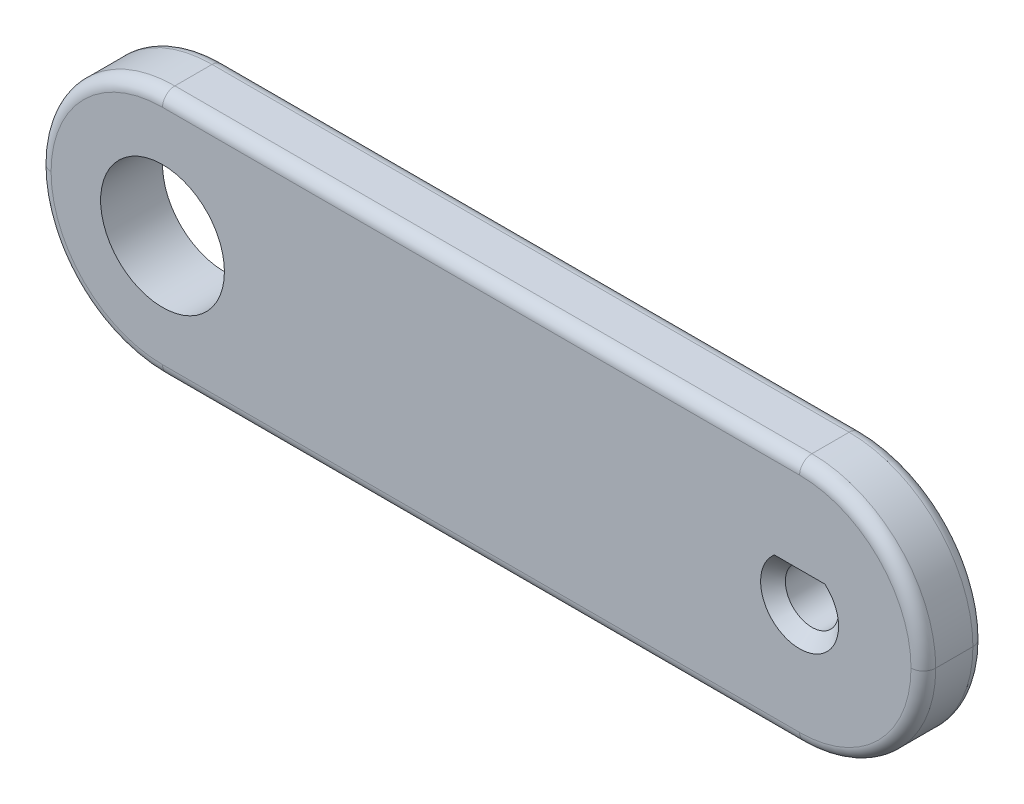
ISO-10303-21;
HEADER;
FILE_DESCRIPTION(('STEP AP214'),'2;1');
FILE_NAME('part.step','',(''),(''),'','','');
FILE_SCHEMA(('AUTOMOTIVE_DESIGN { 1 0 10303 214 1 1 1 1 }'));
ENDSEC;
DATA;
#1=APPLICATION_CONTEXT('core data for automotive mechanical design processes');
#2=APPLICATION_PROTOCOL_DEFINITION('international standard','automotive_design',2000,#1);
#3=PRODUCT_CONTEXT('',#1,'mechanical');
#4=PRODUCT('Part','Part','',(#3));
#5=PRODUCT_RELATED_PRODUCT_CATEGORY('part','',(#4));
#6=PRODUCT_DEFINITION_FORMATION('','',#4);
#7=PRODUCT_DEFINITION_CONTEXT('part definition',#1,'design');
#8=PRODUCT_DEFINITION('design','',#6,#7);
#9=PRODUCT_DEFINITION_SHAPE('','',#8);
#10=(LENGTH_UNIT() NAMED_UNIT(*) SI_UNIT(.MILLI.,.METRE.));
#11=(NAMED_UNIT(*) PLANE_ANGLE_UNIT() SI_UNIT($,.RADIAN.));
#12=(NAMED_UNIT(*) SI_UNIT($,.STERADIAN.) SOLID_ANGLE_UNIT());
#13=UNCERTAINTY_MEASURE_WITH_UNIT(LENGTH_MEASURE(1.E-05),#10,'distance_accuracy_value','');
#14=(GEOMETRIC_REPRESENTATION_CONTEXT(3) GLOBAL_UNCERTAINTY_ASSIGNED_CONTEXT((#13)) GLOBAL_UNIT_ASSIGNED_CONTEXT((#10,
#11,#12)) REPRESENTATION_CONTEXT('',''));
#15=CARTESIAN_POINT('',(0.,0.,0.));
#16=DIRECTION('',(0.,0.,1.));
#17=DIRECTION('',(1.,0.,0.));
#18=AXIS2_PLACEMENT_3D('',#15,#16,#17);
#19=CARTESIAN_POINT('',(0.,0.,5.));
#20=DIRECTION('',(0.,0.,1.));
#21=DIRECTION('',(1.,0.,0.));
#22=AXIS2_PLACEMENT_3D('',#19,#20,#21);
#23=PLANE('',#22);
#24=DIRECTION('',(1.,0.,0.));
#25=VECTOR('',#24,1.);
#26=CARTESIAN_POINT('',(-8.36828311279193,12.4,5.));
#27=LINE('',#26,#25);
#28=CARTESIAN_POINT('',(-12.0402205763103,12.4,5.));
#29=VERTEX_POINT('',#28);
#30=CARTESIAN_POINT('',(-7.95977942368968,12.4,5.));
#31=VERTEX_POINT('',#30);
#32=EDGE_CURVE('E70',#29,#31,#27,.T.);
#33=ORIENTED_EDGE('',*,*,#32,.T.);
#34=CARTESIAN_POINT('',(-10.,10.,5.));
#35=DIRECTION('',(0.,0.,1.));
#36=DIRECTION('',(1.,0.,0.));
#37=AXIS2_PLACEMENT_3D('',#34,#35,#36);
#38=CIRCLE('',#37,3.15000000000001);
#39=EDGE_CURVE('E63',#31,#29,#38,.F.);
#40=ORIENTED_EDGE('',*,*,#39,.T.);
#41=EDGE_LOOP('',(#33,#40));
#42=FACE_BOUND('',#41,.T.);
#43=CARTESIAN_POINT('',(-10.,10.,5.));
#44=DIRECTION('',(0.,0.,1.));
#45=DIRECTION('',(1.,0.,0.));
#46=AXIS2_PLACEMENT_3D('',#43,#44,#45);
#47=CIRCLE('',#46,9.);
#48=CARTESIAN_POINT('',(-10.,0.999999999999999,5.));
#49=VERTEX_POINT('',#48);
#50=CARTESIAN_POINT('',(-1.,10.,5.));
#51=VERTEX_POINT('',#50);
#52=EDGE_CURVE('E283',#49,#51,#47,.T.);
#53=ORIENTED_EDGE('',*,*,#52,.T.);
#54=CARTESIAN_POINT('',(-10.,10.,5.));
#55=DIRECTION('',(0.,0.,1.));
#56=DIRECTION('',(1.,0.,0.));
#57=AXIS2_PLACEMENT_3D('',#54,#55,#56);
#58=CIRCLE('',#57,9.);
#59=CARTESIAN_POINT('',(-10.,19.,5.));
#60=VERTEX_POINT('',#59);
#61=EDGE_CURVE('E286',#51,#60,#58,.T.);
#62=ORIENTED_EDGE('',*,*,#61,.T.);
#63=DIRECTION('',(-1.,0.,0.));
#64=VECTOR('',#63,1.);
#65=CARTESIAN_POINT('',(-61.46,19.,5.));
#66=LINE('',#65,#64);
#67=CARTESIAN_POINT('',(-61.46,19.,5.));
#68=VERTEX_POINT('',#67);
#69=EDGE_CURVE('E271',#60,#68,#66,.T.);
#70=ORIENTED_EDGE('',*,*,#69,.T.);
#71=CARTESIAN_POINT('',(-61.46,10.,5.));
#72=DIRECTION('',(0.,0.,1.));
#73=DIRECTION('',(1.,0.,0.));
#74=AXIS2_PLACEMENT_3D('',#71,#72,#73);
#75=CIRCLE('',#74,9.);
#76=CARTESIAN_POINT('',(-70.46,10.,5.));
#77=VERTEX_POINT('',#76);
#78=EDGE_CURVE('E274',#68,#77,#75,.T.);
#79=ORIENTED_EDGE('',*,*,#78,.T.);
#80=CARTESIAN_POINT('',(-61.46,9.99999999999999,5.));
#81=DIRECTION('',(0.,0.,1.));
#82=DIRECTION('',(1.,0.,0.));
#83=AXIS2_PLACEMENT_3D('',#80,#81,#82);
#84=CIRCLE('',#83,9.);
#85=CARTESIAN_POINT('',(-61.46,0.999999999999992,5.));
#86=VERTEX_POINT('',#85);
#87=EDGE_CURVE('E277',#77,#86,#84,.T.);
#88=ORIENTED_EDGE('',*,*,#87,.T.);
#89=DIRECTION('',(1.,0.,0.));
#90=VECTOR('',#89,1.);
#91=CARTESIAN_POINT('',(-10.,0.999999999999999,5.));
#92=LINE('',#91,#90);
#93=EDGE_CURVE('E280',#86,#49,#92,.T.);
#94=ORIENTED_EDGE('',*,*,#93,.T.);
#95=EDGE_LOOP('',(#53,#62,#70,#79,#88,#94));
#96=FACE_BOUND('',#95,.T.);
#97=CARTESIAN_POINT('',(-61.46,10.,5.));
#98=DIRECTION('',(0.,0.,1.));
#99=DIRECTION('',(1.,0.,0.));
#100=AXIS2_PLACEMENT_3D('',#97,#98,#99);
#101=CIRCLE('',#100,5.);
#102=CARTESIAN_POINT('',(-56.46,10.,5.));
#103=VERTEX_POINT('',#102);
#104=EDGE_CURVE('E187',#103,#103,#101,.T.);
#105=ORIENTED_EDGE('',*,*,#104,.F.);
#106=EDGE_LOOP('',(#105));
#107=FACE_BOUND('',#106,.T.);
#108=ADVANCED_FACE('F47',(#42,#96,#107),#23,.T.);
#109=CARTESIAN_POINT('',(0.,0.,0.));
#110=DIRECTION('',(0.,0.,1.));
#111=DIRECTION('',(1.,0.,0.));
#112=AXIS2_PLACEMENT_3D('',#109,#110,#111);
#113=PLANE('',#112);
#114=DIRECTION('',(-1.,0.,0.));
#115=VECTOR('',#114,1.);
#116=CARTESIAN_POINT('',(0.,19.,0.));
#117=LINE('',#116,#115);
#118=CARTESIAN_POINT('',(-61.46,19.,0.));
#119=VERTEX_POINT('',#118);
#120=CARTESIAN_POINT('',(-10.,19.,0.));
#121=VERTEX_POINT('',#120);
#122=EDGE_CURVE('E212',#119,#121,#117,.F.);
#123=ORIENTED_EDGE('',*,*,#122,.T.);
#124=CARTESIAN_POINT('',(-10.,10.,0.));
#125=DIRECTION('',(0.,0.,1.));
#126=DIRECTION('',(1.,0.,0.));
#127=AXIS2_PLACEMENT_3D('',#124,#125,#126);
#128=CIRCLE('',#127,9.);
#129=CARTESIAN_POINT('',(-1.,10.,0.));
#130=VERTEX_POINT('',#129);
#131=EDGE_CURVE('E235',#121,#130,#128,.F.);
#132=ORIENTED_EDGE('',*,*,#131,.T.);
#133=CARTESIAN_POINT('',(-10.,10.,0.));
#134=DIRECTION('',(0.,0.,1.));
#135=DIRECTION('',(1.,0.,0.));
#136=AXIS2_PLACEMENT_3D('',#133,#134,#135);
#137=CIRCLE('',#136,9.);
#138=CARTESIAN_POINT('',(-10.,0.999999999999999,0.));
#139=VERTEX_POINT('',#138);
#140=EDGE_CURVE('E232',#130,#139,#137,.F.);
#141=ORIENTED_EDGE('',*,*,#140,.T.);
#142=DIRECTION('',(1.,0.,0.));
#143=VECTOR('',#142,1.);
#144=CARTESIAN_POINT('',(0.,1.,0.));
#145=LINE('',#144,#143);
#146=CARTESIAN_POINT('',(-61.46,0.999999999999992,0.));
#147=VERTEX_POINT('',#146);
#148=EDGE_CURVE('E229',#139,#147,#145,.F.);
#149=ORIENTED_EDGE('',*,*,#148,.T.);
#150=CARTESIAN_POINT('',(-61.46,9.99999999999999,0.));
#151=DIRECTION('',(0.,0.,1.));
#152=DIRECTION('',(1.,0.,0.));
#153=AXIS2_PLACEMENT_3D('',#150,#151,#152);
#154=CIRCLE('',#153,9.);
#155=CARTESIAN_POINT('',(-70.46,10.,0.));
#156=VERTEX_POINT('',#155);
#157=EDGE_CURVE('E226',#147,#156,#154,.F.);
#158=ORIENTED_EDGE('',*,*,#157,.T.);
#159=CARTESIAN_POINT('',(-61.46,10.,0.));
#160=DIRECTION('',(0.,0.,1.));
#161=DIRECTION('',(1.,0.,0.));
#162=AXIS2_PLACEMENT_3D('',#159,#160,#161);
#163=CIRCLE('',#162,9.);
#164=EDGE_CURVE('E223',#156,#119,#163,.F.);
#165=ORIENTED_EDGE('',*,*,#164,.T.);
#166=EDGE_LOOP('',(#123,#132,#141,#149,#158,#165));
#167=FACE_BOUND('',#166,.T.);
#168=CARTESIAN_POINT('',(-61.46,10.,0.));
#169=DIRECTION('',(0.,0.,1.));
#170=DIRECTION('',(1.,0.,0.));
#171=AXIS2_PLACEMENT_3D('',#168,#169,#170);
#172=CIRCLE('',#171,5.);
#173=CARTESIAN_POINT('',(-56.46,10.,0.));
#174=VERTEX_POINT('',#173);
#175=EDGE_CURVE('E192',#174,#174,#172,.T.);
#176=ORIENTED_EDGE('',*,*,#175,.T.);
#177=EDGE_LOOP('',(#176));
#178=FACE_BOUND('',#177,.T.);
#179=DIRECTION('',(1.,0.,0.));
#180=VECTOR('',#179,1.);
#181=CARTESIAN_POINT('',(-11.6317168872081,11.4,0.));
#182=LINE('',#181,#180);
#183=CARTESIAN_POINT('',(-11.6317168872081,11.4,0.));
#184=VERTEX_POINT('',#183);
#185=CARTESIAN_POINT('',(-8.36828311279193,11.4,0.));
#186=VERTEX_POINT('',#185);
#187=EDGE_CURVE('E165',#184,#186,#182,.T.);
#188=ORIENTED_EDGE('',*,*,#187,.F.);
#189=CARTESIAN_POINT('',(-10.,10.,0.));
#190=DIRECTION('',(0.,0.,1.));
#191=DIRECTION('',(1.,0.,0.));
#192=AXIS2_PLACEMENT_3D('',#189,#190,#191);
#193=CIRCLE('',#192,2.15);
#194=EDGE_CURVE('E161',#186,#184,#193,.F.);
#195=ORIENTED_EDGE('',*,*,#194,.F.);
#196=EDGE_LOOP('',(#188,#195));
#197=FACE_BOUND('',#196,.T.);
#198=ADVANCED_FACE('F163',(#167,#178,#197),#113,.F.);
#199=CARTESIAN_POINT('',(0.,20.,5.));
#200=DIRECTION('',(0.,-1.,0.));
#201=DIRECTION('',(1.,0.,0.));
#202=AXIS2_PLACEMENT_3D('',#199,#200,#201);
#203=PLANE('',#202);
#204=DIRECTION('',(0.,0.,-1.));
#205=VECTOR('',#204,1.);
#206=CARTESIAN_POINT('',(-10.,20.,5.));
#207=LINE('',#206,#205);
#208=CARTESIAN_POINT('',(-10.,20.,4.));
#209=VERTEX_POINT('',#208);
#210=CARTESIAN_POINT('',(-10.,20.,1.));
#211=VERTEX_POINT('',#210);
#212=EDGE_CURVE('E204',#209,#211,#207,.T.);
#213=ORIENTED_EDGE('',*,*,#212,.T.);
#214=DIRECTION('',(-1.,0.,0.));
#215=VECTOR('',#214,1.);
#216=CARTESIAN_POINT('',(0.,20.,1.));
#217=LINE('',#216,#215);
#218=CARTESIAN_POINT('',(-61.46,20.,1.));
#219=VERTEX_POINT('',#218);
#220=EDGE_CURVE('E293',#211,#219,#217,.T.);
#221=ORIENTED_EDGE('',*,*,#220,.T.);
#222=DIRECTION('',(0.,0.,-1.));
#223=VECTOR('',#222,1.);
#224=CARTESIAN_POINT('',(-61.46,20.,5.));
#225=LINE('',#224,#223);
#226=CARTESIAN_POINT('',(-61.46,20.,4.));
#227=VERTEX_POINT('',#226);
#228=EDGE_CURVE('E208',#219,#227,#225,.F.);
#229=ORIENTED_EDGE('',*,*,#228,.T.);
#230=DIRECTION('',(-1.,0.,0.));
#231=VECTOR('',#230,1.);
#232=CARTESIAN_POINT('',(-10.,20.,4.));
#233=LINE('',#232,#231);
#234=EDGE_CURVE('E290',#227,#209,#233,.F.);
#235=ORIENTED_EDGE('',*,*,#234,.T.);
#236=EDGE_LOOP('',(#213,#221,#229,#235));
#237=FACE_BOUND('',#236,.T.);
#238=ADVANCED_FACE('F422',(#237),#203,.F.);
#239=CARTESIAN_POINT('',(0.,0.,5.));
#240=DIRECTION('',(0.,1.,0.));
#241=DIRECTION('',(-1.,0.,0.));
#242=AXIS2_PLACEMENT_3D('',#239,#240,#241);
#243=PLANE('',#242);
#244=DIRECTION('',(0.,0.,-1.));
#245=VECTOR('',#244,1.);
#246=CARTESIAN_POINT('',(-61.46,0.,5.));
#247=LINE('',#246,#245);
#248=CARTESIAN_POINT('',(-61.46,0.,4.));
#249=VERTEX_POINT('',#248);
#250=CARTESIAN_POINT('',(-61.46,0.,1.));
#251=VERTEX_POINT('',#250);
#252=EDGE_CURVE('E200',#249,#251,#247,.T.);
#253=ORIENTED_EDGE('',*,*,#252,.T.);
#254=DIRECTION('',(1.,0.,0.));
#255=VECTOR('',#254,1.);
#256=CARTESIAN_POINT('',(0.,0.,1.));
#257=LINE('',#256,#255);
#258=CARTESIAN_POINT('',(-10.,0.,1.));
#259=VERTEX_POINT('',#258);
#260=EDGE_CURVE('E256',#251,#259,#257,.T.);
#261=ORIENTED_EDGE('',*,*,#260,.T.);
#262=DIRECTION('',(0.,0.,-1.));
#263=VECTOR('',#262,1.);
#264=CARTESIAN_POINT('',(-10.,0.,5.));
#265=LINE('',#264,#263);
#266=CARTESIAN_POINT('',(-10.,0.,4.));
#267=VERTEX_POINT('',#266);
#268=EDGE_CURVE('E191',#259,#267,#265,.F.);
#269=ORIENTED_EDGE('',*,*,#268,.T.);
#270=DIRECTION('',(1.,0.,0.));
#271=VECTOR('',#270,1.);
#272=CARTESIAN_POINT('',(-61.46,0.,4.));
#273=LINE('',#272,#271);
#274=EDGE_CURVE('E253',#267,#249,#273,.F.);
#275=ORIENTED_EDGE('',*,*,#274,.T.);
#276=EDGE_LOOP('',(#253,#261,#269,#275));
#277=FACE_BOUND('',#276,.T.);
#278=ADVANCED_FACE('F425',(#277),#243,.F.);
#279=CARTESIAN_POINT('',(-61.46,10.,5.));
#280=DIRECTION('',(0.,0.,-1.));
#281=DIRECTION('',(-1.,0.,0.));
#282=AXIS2_PLACEMENT_3D('',#279,#280,#281);
#283=CYLINDRICAL_SURFACE('',#282,5.);
#284=ORIENTED_EDGE('',*,*,#104,.T.);
#285=EDGE_LOOP('',(#284));
#286=FACE_BOUND('',#285,.T.);
#287=ORIENTED_EDGE('',*,*,#175,.F.);
#288=EDGE_LOOP('',(#287));
#289=FACE_BOUND('',#288,.T.);
#290=ADVANCED_FACE('F417',(#286,#289),#283,.F.);
#291=CARTESIAN_POINT('',(-61.46,10.,5.));
#292=DIRECTION('',(0.,0.,-1.));
#293=DIRECTION('',(-1.,0.,0.));
#294=AXIS2_PLACEMENT_3D('',#291,#292,#293);
#295=CYLINDRICAL_SURFACE('',#294,10.);
#296=ORIENTED_EDGE('',*,*,#228,.F.);
#297=CARTESIAN_POINT('',(-61.46,10.,1.));
#298=DIRECTION('',(0.,0.,1.));
#299=DIRECTION('',(1.,0.,0.));
#300=AXIS2_PLACEMENT_3D('',#297,#298,#299);
#301=CIRCLE('',#300,10.);
#302=CARTESIAN_POINT('',(-71.46,10.,1.));
#303=VERTEX_POINT('',#302);
#304=EDGE_CURVE('E268',#219,#303,#301,.T.);
#305=ORIENTED_EDGE('',*,*,#304,.T.);
#306=DIRECTION('',(0.,0.,-1.));
#307=VECTOR('',#306,1.);
#308=CARTESIAN_POINT('',(-71.46,10.,5.));
#309=LINE('',#308,#307);
#310=CARTESIAN_POINT('',(-71.46,10.,4.));
#311=VERTEX_POINT('',#310);
#312=EDGE_CURVE('E196',#311,#303,#309,.T.);
#313=ORIENTED_EDGE('',*,*,#312,.F.);
#314=CARTESIAN_POINT('',(-61.46,10.,4.));
#315=DIRECTION('',(0.,0.,1.));
#316=DIRECTION('',(1.,0.,0.));
#317=AXIS2_PLACEMENT_3D('',#314,#315,#316);
#318=CIRCLE('',#317,10.);
#319=EDGE_CURVE('E265',#311,#227,#318,.F.);
#320=ORIENTED_EDGE('',*,*,#319,.T.);
#321=EDGE_LOOP('',(#296,#305,#313,#320));
#322=FACE_BOUND('',#321,.T.);
#323=ADVANCED_FACE('F414',(#322),#295,.T.);
#324=CARTESIAN_POINT('',(-61.46,9.99999999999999,5.));
#325=DIRECTION('',(0.,0.,-1.));
#326=DIRECTION('',(-1.,0.,0.));
#327=AXIS2_PLACEMENT_3D('',#324,#325,#326);
#328=CYLINDRICAL_SURFACE('',#327,10.);
#329=ORIENTED_EDGE('',*,*,#312,.T.);
#330=CARTESIAN_POINT('',(-61.46,9.99999999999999,1.));
#331=DIRECTION('',(0.,0.,1.));
#332=DIRECTION('',(1.,0.,0.));
#333=AXIS2_PLACEMENT_3D('',#330,#331,#332);
#334=CIRCLE('',#333,10.);
#335=EDGE_CURVE('E262',#303,#251,#334,.T.);
#336=ORIENTED_EDGE('',*,*,#335,.T.);
#337=ORIENTED_EDGE('',*,*,#252,.F.);
#338=CARTESIAN_POINT('',(-61.46,9.99999999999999,4.));
#339=DIRECTION('',(0.,0.,1.));
#340=DIRECTION('',(1.,0.,0.));
#341=AXIS2_PLACEMENT_3D('',#338,#339,#340);
#342=CIRCLE('',#341,10.);
#343=EDGE_CURVE('E259',#249,#311,#342,.F.);
#344=ORIENTED_EDGE('',*,*,#343,.T.);
#345=EDGE_LOOP('',(#329,#336,#337,#344));
#346=FACE_BOUND('',#345,.T.);
#347=ADVANCED_FACE('F409',(#346),#328,.T.);
#348=CARTESIAN_POINT('',(-10.,10.,5.));
#349=DIRECTION('',(0.,0.,-1.));
#350=DIRECTION('',(-1.,0.,0.));
#351=AXIS2_PLACEMENT_3D('',#348,#349,#350);
#352=CYLINDRICAL_SURFACE('',#351,10.);
#353=DIRECTION('',(0.,0.,-1.));
#354=VECTOR('',#353,1.);
#355=CARTESIAN_POINT('',(0.,10.,5.));
#356=LINE('',#355,#354);
#357=CARTESIAN_POINT('',(0.,10.,1.));
#358=VERTEX_POINT('',#357);
#359=CARTESIAN_POINT('',(0.,10.,4.));
#360=VERTEX_POINT('',#359);
#361=EDGE_CURVE('E216',#358,#360,#356,.F.);
#362=ORIENTED_EDGE('',*,*,#361,.F.);
#363=CARTESIAN_POINT('',(-10.,10.,1.));
#364=DIRECTION('',(0.,0.,1.));
#365=DIRECTION('',(1.,0.,0.));
#366=AXIS2_PLACEMENT_3D('',#363,#364,#365);
#367=CIRCLE('',#366,10.);
#368=EDGE_CURVE('E243',#358,#211,#367,.T.);
#369=ORIENTED_EDGE('',*,*,#368,.T.);
#370=ORIENTED_EDGE('',*,*,#212,.F.);
#371=CARTESIAN_POINT('',(-10.,10.,4.));
#372=DIRECTION('',(0.,0.,1.));
#373=DIRECTION('',(1.,0.,0.));
#374=AXIS2_PLACEMENT_3D('',#371,#372,#373);
#375=CIRCLE('',#374,10.);
#376=EDGE_CURVE('E239',#209,#360,#375,.F.);
#377=ORIENTED_EDGE('',*,*,#376,.T.);
#378=EDGE_LOOP('',(#362,#369,#370,#377));
#379=FACE_BOUND('',#378,.T.);
#380=ADVANCED_FACE('F406',(#379),#352,.T.);
#381=CARTESIAN_POINT('',(-10.,10.,5.));
#382=DIRECTION('',(0.,0.,-1.));
#383=DIRECTION('',(-1.,0.,0.));
#384=AXIS2_PLACEMENT_3D('',#381,#382,#383);
#385=CYLINDRICAL_SURFACE('',#384,10.);
#386=ORIENTED_EDGE('',*,*,#268,.F.);
#387=CARTESIAN_POINT('',(-10.,10.,1.));
#388=DIRECTION('',(0.,0.,1.));
#389=DIRECTION('',(1.,0.,0.));
#390=AXIS2_PLACEMENT_3D('',#387,#388,#389);
#391=CIRCLE('',#390,10.);
#392=EDGE_CURVE('E250',#259,#358,#391,.T.);
#393=ORIENTED_EDGE('',*,*,#392,.T.);
#394=ORIENTED_EDGE('',*,*,#361,.T.);
#395=CARTESIAN_POINT('',(-10.,10.,4.));
#396=DIRECTION('',(0.,0.,1.));
#397=DIRECTION('',(1.,0.,0.));
#398=AXIS2_PLACEMENT_3D('',#395,#396,#397);
#399=CIRCLE('',#398,10.);
#400=EDGE_CURVE('E247',#360,#267,#399,.F.);
#401=ORIENTED_EDGE('',*,*,#400,.T.);
#402=EDGE_LOOP('',(#386,#393,#394,#401));
#403=FACE_BOUND('',#402,.T.);
#404=ADVANCED_FACE('F386',(#403),#385,.T.);
#405=CARTESIAN_POINT('',(-61.46,9.99999999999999,1.));
#406=DIRECTION('',(0.,0.,1.));
#407=DIRECTION('',(1.,0.,0.));
#408=AXIS2_PLACEMENT_3D('',#405,#406,#407);
#409=TOROIDAL_SURFACE('',#408,9.,1.);
#410=CARTESIAN_POINT('',(-61.46,0.999999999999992,1.));
#411=DIRECTION('',(1.,0.,0.));
#412=DIRECTION('',(0.,0.,-1.));
#413=AXIS2_PLACEMENT_3D('',#410,#411,#412);
#414=CIRCLE('',#413,1.);
#415=EDGE_CURVE('E311',#251,#147,#414,.T.);
#416=ORIENTED_EDGE('',*,*,#415,.F.);
#417=ORIENTED_EDGE('',*,*,#335,.F.);
#418=CARTESIAN_POINT('',(-70.46,10.,1.));
#419=DIRECTION('',(0.,1.,0.));
#420=DIRECTION('',(-1.,0.,0.));
#421=AXIS2_PLACEMENT_3D('',#418,#419,#420);
#422=CIRCLE('',#421,1.);
#423=EDGE_CURVE('E220',#156,#303,#422,.T.);
#424=ORIENTED_EDGE('',*,*,#423,.F.);
#425=ORIENTED_EDGE('',*,*,#157,.F.);
#426=EDGE_LOOP('',(#416,#417,#424,#425));
#427=FACE_BOUND('',#426,.T.);
#428=ADVANCED_FACE('F382',(#427),#409,.T.);
#429=CARTESIAN_POINT('',(-61.46,10.,1.));
#430=DIRECTION('',(0.,0.,1.));
#431=DIRECTION('',(1.,0.,0.));
#432=AXIS2_PLACEMENT_3D('',#429,#430,#431);
#433=TOROIDAL_SURFACE('',#432,9.,1.);
#434=ORIENTED_EDGE('',*,*,#423,.T.);
#435=ORIENTED_EDGE('',*,*,#304,.F.);
#436=CARTESIAN_POINT('',(-61.46,19.,1.));
#437=DIRECTION('',(1.,0.,0.));
#438=DIRECTION('',(0.,0.,-1.));
#439=AXIS2_PLACEMENT_3D('',#436,#437,#438);
#440=CIRCLE('',#439,1.);
#441=EDGE_CURVE('E307',#119,#219,#440,.T.);
#442=ORIENTED_EDGE('',*,*,#441,.F.);
#443=ORIENTED_EDGE('',*,*,#164,.F.);
#444=EDGE_LOOP('',(#434,#435,#442,#443));
#445=FACE_BOUND('',#444,.T.);
#446=ADVANCED_FACE('F385',(#445),#433,.T.);
#447=CARTESIAN_POINT('',(0.,1.,1.));
#448=DIRECTION('',(1.,0.,0.));
#449=DIRECTION('',(0.,1.,0.));
#450=AXIS2_PLACEMENT_3D('',#447,#448,#449);
#451=CYLINDRICAL_SURFACE('',#450,1.);
#452=ORIENTED_EDGE('',*,*,#415,.T.);
#453=ORIENTED_EDGE('',*,*,#148,.F.);
#454=CARTESIAN_POINT('',(-10.,0.999999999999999,1.));
#455=DIRECTION('',(1.,0.,0.));
#456=DIRECTION('',(0.,0.,-1.));
#457=AXIS2_PLACEMENT_3D('',#454,#455,#456);
#458=CIRCLE('',#457,1.);
#459=EDGE_CURVE('E303',#259,#139,#458,.T.);
#460=ORIENTED_EDGE('',*,*,#459,.F.);
#461=ORIENTED_EDGE('',*,*,#260,.F.);
#462=EDGE_LOOP('',(#452,#453,#460,#461));
#463=FACE_BOUND('',#462,.T.);
#464=ADVANCED_FACE('F390',(#463),#451,.T.);
#465=CARTESIAN_POINT('',(0.,19.,1.));
#466=DIRECTION('',(-1.,0.,0.));
#467=DIRECTION('',(0.,-1.,0.));
#468=AXIS2_PLACEMENT_3D('',#465,#466,#467);
#469=CYLINDRICAL_SURFACE('',#468,1.);
#470=ORIENTED_EDGE('',*,*,#441,.T.);
#471=ORIENTED_EDGE('',*,*,#220,.F.);
#472=CARTESIAN_POINT('',(-10.,19.,1.));
#473=DIRECTION('',(1.,0.,0.));
#474=DIRECTION('',(0.,0.,-1.));
#475=AXIS2_PLACEMENT_3D('',#472,#473,#474);
#476=CIRCLE('',#475,1.);
#477=EDGE_CURVE('E299',#121,#211,#476,.T.);
#478=ORIENTED_EDGE('',*,*,#477,.F.);
#479=ORIENTED_EDGE('',*,*,#122,.F.);
#480=EDGE_LOOP('',(#470,#471,#478,#479));
#481=FACE_BOUND('',#480,.T.);
#482=ADVANCED_FACE('F394',(#481),#469,.T.);
#483=CARTESIAN_POINT('',(-10.,10.,1.));
#484=DIRECTION('',(0.,0.,1.));
#485=DIRECTION('',(1.,0.,0.));
#486=AXIS2_PLACEMENT_3D('',#483,#484,#485);
#487=TOROIDAL_SURFACE('',#486,9.,1.);
#488=ORIENTED_EDGE('',*,*,#459,.T.);
#489=ORIENTED_EDGE('',*,*,#140,.F.);
#490=CARTESIAN_POINT('',(-1.,10.,1.));
#491=DIRECTION('',(0.,1.,0.));
#492=DIRECTION('',(0.,0.,1.));
#493=AXIS2_PLACEMENT_3D('',#490,#491,#492);
#494=CIRCLE('',#493,1.);
#495=EDGE_CURVE('E296',#358,#130,#494,.T.);
#496=ORIENTED_EDGE('',*,*,#495,.F.);
#497=ORIENTED_EDGE('',*,*,#392,.F.);
#498=EDGE_LOOP('',(#488,#489,#496,#497));
#499=FACE_BOUND('',#498,.T.);
#500=ADVANCED_FACE('F398',(#499),#487,.T.);
#501=CARTESIAN_POINT('',(-10.,10.,1.));
#502=DIRECTION('',(0.,0.,1.));
#503=DIRECTION('',(1.,0.,0.));
#504=AXIS2_PLACEMENT_3D('',#501,#502,#503);
#505=TOROIDAL_SURFACE('',#504,9.,1.);
#506=ORIENTED_EDGE('',*,*,#477,.T.);
#507=ORIENTED_EDGE('',*,*,#368,.F.);
#508=ORIENTED_EDGE('',*,*,#495,.T.);
#509=ORIENTED_EDGE('',*,*,#131,.F.);
#510=EDGE_LOOP('',(#506,#507,#508,#509));
#511=FACE_BOUND('',#510,.T.);
#512=ADVANCED_FACE('F361',(#511),#505,.T.);
#513=CARTESIAN_POINT('',(-61.46,9.99999999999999,4.));
#514=DIRECTION('',(0.,0.,1.));
#515=DIRECTION('',(1.,0.,0.));
#516=AXIS2_PLACEMENT_3D('',#513,#514,#515);
#517=TOROIDAL_SURFACE('',#516,9.,1.);
#518=CARTESIAN_POINT('',(-70.46,10.,4.));
#519=DIRECTION('',(0.,1.,0.));
#520=DIRECTION('',(-1.,0.,0.));
#521=AXIS2_PLACEMENT_3D('',#518,#519,#520);
#522=CIRCLE('',#521,1.);
#523=EDGE_CURVE('E331',#311,#77,#522,.T.);
#524=ORIENTED_EDGE('',*,*,#523,.F.);
#525=ORIENTED_EDGE('',*,*,#343,.F.);
#526=CARTESIAN_POINT('',(-61.46,0.999999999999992,4.));
#527=DIRECTION('',(1.,0.,0.));
#528=DIRECTION('',(0.,0.,-1.));
#529=AXIS2_PLACEMENT_3D('',#526,#527,#528);
#530=CIRCLE('',#529,1.);
#531=EDGE_CURVE('E300',#86,#249,#530,.T.);
#532=ORIENTED_EDGE('',*,*,#531,.F.);
#533=ORIENTED_EDGE('',*,*,#87,.F.);
#534=EDGE_LOOP('',(#524,#525,#532,#533));
#535=FACE_BOUND('',#534,.T.);
#536=ADVANCED_FACE('F356',(#535),#517,.T.);
#537=CARTESIAN_POINT('',(0.,1.,4.));
#538=DIRECTION('',(-1.,0.,0.));
#539=DIRECTION('',(0.,-1.,0.));
#540=AXIS2_PLACEMENT_3D('',#537,#538,#539);
#541=CYLINDRICAL_SURFACE('',#540,1.);
#542=ORIENTED_EDGE('',*,*,#531,.T.);
#543=ORIENTED_EDGE('',*,*,#274,.F.);
#544=CARTESIAN_POINT('',(-10.,0.999999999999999,4.));
#545=DIRECTION('',(1.,0.,0.));
#546=DIRECTION('',(0.,0.,-1.));
#547=AXIS2_PLACEMENT_3D('',#544,#545,#546);
#548=CIRCLE('',#547,1.);
#549=EDGE_CURVE('E327',#49,#267,#548,.T.);
#550=ORIENTED_EDGE('',*,*,#549,.F.);
#551=ORIENTED_EDGE('',*,*,#93,.F.);
#552=EDGE_LOOP('',(#542,#543,#550,#551));
#553=FACE_BOUND('',#552,.T.);
#554=ADVANCED_FACE('F360',(#553),#541,.T.);
#555=CARTESIAN_POINT('',(-61.46,10.,4.));
#556=DIRECTION('',(0.,0.,1.));
#557=DIRECTION('',(1.,0.,0.));
#558=AXIS2_PLACEMENT_3D('',#555,#556,#557);
#559=TOROIDAL_SURFACE('',#558,9.,1.);
#560=ORIENTED_EDGE('',*,*,#523,.T.);
#561=ORIENTED_EDGE('',*,*,#78,.F.);
#562=CARTESIAN_POINT('',(-61.46,19.,4.));
#563=DIRECTION('',(1.,0.,0.));
#564=DIRECTION('',(0.,0.,-1.));
#565=AXIS2_PLACEMENT_3D('',#562,#563,#564);
#566=CIRCLE('',#565,1.);
#567=EDGE_CURVE('E323',#227,#68,#566,.T.);
#568=ORIENTED_EDGE('',*,*,#567,.F.);
#569=ORIENTED_EDGE('',*,*,#319,.F.);
#570=EDGE_LOOP('',(#560,#561,#568,#569));
#571=FACE_BOUND('',#570,.T.);
#572=ADVANCED_FACE('F365',(#571),#559,.T.);
#573=CARTESIAN_POINT('',(-10.,10.,4.));
#574=DIRECTION('',(0.,0.,1.));
#575=DIRECTION('',(1.,0.,0.));
#576=AXIS2_PLACEMENT_3D('',#573,#574,#575);
#577=TOROIDAL_SURFACE('',#576,9.,1.);
#578=ORIENTED_EDGE('',*,*,#549,.T.);
#579=ORIENTED_EDGE('',*,*,#400,.F.);
#580=CARTESIAN_POINT('',(-1.,10.,4.));
#581=DIRECTION('',(0.,1.,0.));
#582=DIRECTION('',(0.,0.,1.));
#583=AXIS2_PLACEMENT_3D('',#580,#581,#582);
#584=CIRCLE('',#583,1.);
#585=EDGE_CURVE('E320',#51,#360,#584,.T.);
#586=ORIENTED_EDGE('',*,*,#585,.F.);
#587=ORIENTED_EDGE('',*,*,#52,.F.);
#588=EDGE_LOOP('',(#578,#579,#586,#587));
#589=FACE_BOUND('',#588,.T.);
#590=ADVANCED_FACE('F369',(#589),#577,.T.);
#591=CARTESIAN_POINT('',(0.,19.,4.));
#592=DIRECTION('',(1.,0.,0.));
#593=DIRECTION('',(0.,1.,0.));
#594=AXIS2_PLACEMENT_3D('',#591,#592,#593);
#595=CYLINDRICAL_SURFACE('',#594,1.);
#596=ORIENTED_EDGE('',*,*,#567,.T.);
#597=ORIENTED_EDGE('',*,*,#69,.F.);
#598=CARTESIAN_POINT('',(-10.,19.,4.));
#599=DIRECTION('',(1.,0.,0.));
#600=DIRECTION('',(0.,0.,-1.));
#601=AXIS2_PLACEMENT_3D('',#598,#599,#600);
#602=CIRCLE('',#601,1.);
#603=EDGE_CURVE('E170',#209,#60,#602,.T.);
#604=ORIENTED_EDGE('',*,*,#603,.F.);
#605=ORIENTED_EDGE('',*,*,#234,.F.);
#606=EDGE_LOOP('',(#596,#597,#604,#605));
#607=FACE_BOUND('',#606,.T.);
#608=ADVANCED_FACE('F373',(#607),#595,.T.);
#609=CARTESIAN_POINT('',(-10.,10.,4.));
#610=DIRECTION('',(0.,0.,1.));
#611=DIRECTION('',(1.,0.,0.));
#612=AXIS2_PLACEMENT_3D('',#609,#610,#611);
#613=TOROIDAL_SURFACE('',#612,9.,1.);
#614=ORIENTED_EDGE('',*,*,#585,.T.);
#615=ORIENTED_EDGE('',*,*,#376,.F.);
#616=ORIENTED_EDGE('',*,*,#603,.T.);
#617=ORIENTED_EDGE('',*,*,#61,.F.);
#618=EDGE_LOOP('',(#614,#615,#616,#617));
#619=FACE_BOUND('',#618,.T.);
#620=ADVANCED_FACE('F377',(#619),#613,.T.);
#621=CARTESIAN_POINT('',(-11.6317168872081,11.4,-14.142135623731));
#622=DIRECTION('',(0.,1.,0.));
#623=DIRECTION('',(0.,0.,1.));
#624=AXIS2_PLACEMENT_3D('',#621,#622,#623);
#625=PLANE('',#624);
#626=DIRECTION('',(0.,0.,1.));
#627=VECTOR('',#626,1.);
#628=CARTESIAN_POINT('',(-8.36828311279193,11.4,-14.142135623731));
#629=LINE('',#628,#627);
#630=CARTESIAN_POINT('',(-8.36828311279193,11.4,3.99999999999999));
#631=VERTEX_POINT('',#630);
#632=EDGE_CURVE('E174',#186,#631,#629,.T.);
#633=ORIENTED_EDGE('',*,*,#632,.T.);
#634=DIRECTION('',(-1.,0.,0.));
#635=VECTOR('',#634,1.);
#636=CARTESIAN_POINT('',(-11.6317168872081,11.4,3.99999999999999));
#637=LINE('',#636,#635);
#638=CARTESIAN_POINT('',(-11.6317168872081,11.4,3.99999999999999));
#639=VERTEX_POINT('',#638);
#640=EDGE_CURVE('E11',#631,#639,#637,.T.);
#641=ORIENTED_EDGE('',*,*,#640,.T.);
#642=DIRECTION('',(0.,0.,1.));
#643=VECTOR('',#642,1.);
#644=CARTESIAN_POINT('',(-11.6317168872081,11.4,-14.142135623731));
#645=LINE('',#644,#643);
#646=EDGE_CURVE('E179',#184,#639,#645,.T.);
#647=ORIENTED_EDGE('',*,*,#646,.F.);
#648=ORIENTED_EDGE('',*,*,#187,.T.);
#649=EDGE_LOOP('',(#633,#641,#647,#648));
#650=FACE_BOUND('',#649,.T.);
#651=ADVANCED_FACE('F181',(#650),#625,.F.);
#652=CARTESIAN_POINT('',(-10.,10.,-14.142135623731));
#653=DIRECTION('',(0.,0.,1.));
#654=DIRECTION('',(1.,0.,0.));
#655=AXIS2_PLACEMENT_3D('',#652,#653,#654);
#656=CYLINDRICAL_SURFACE('',#655,2.15);
#657=ORIENTED_EDGE('',*,*,#646,.T.);
#658=CARTESIAN_POINT('',(-10.,10.,3.99999999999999));
#659=DIRECTION('',(0.,0.,1.));
#660=DIRECTION('',(1.,0.,0.));
#661=AXIS2_PLACEMENT_3D('',#658,#659,#660);
#662=CIRCLE('',#661,2.15);
#663=EDGE_CURVE('E176',#639,#631,#662,.T.);
#664=ORIENTED_EDGE('',*,*,#663,.T.);
#665=ORIENTED_EDGE('',*,*,#632,.F.);
#666=ORIENTED_EDGE('',*,*,#194,.T.);
#667=EDGE_LOOP('',(#657,#664,#665,#666));
#668=FACE_BOUND('',#667,.T.);
#669=ADVANCED_FACE('F175',(#668),#656,.F.);
#670=CARTESIAN_POINT('',(-11.6317168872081,11.4,3.99999999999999));
#671=DIRECTION('',(0.,-0.707106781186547,0.707106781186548));
#672=DIRECTION('',(1.,0.,0.));
#673=AXIS2_PLACEMENT_3D('',#670,#671,#672);
#674=PLANE('',#673);
#675=CARTESIAN_POINT('',(-8.36828311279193,11.4,3.99999999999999));
#676=CARTESIAN_POINT('',(-8.33036993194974,11.4825244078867,4.08252440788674));
#677=CARTESIAN_POINT('',(-8.29362102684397,11.5653114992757,4.16531149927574));
#678=CARTESIAN_POINT('',(-8.22215115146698,11.7313030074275,4.33130300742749));
#679=CARTESIAN_POINT('',(-8.18742973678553,11.814507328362,4.41450732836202));
#680=CARTESIAN_POINT('',(-8.1197011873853,11.9812533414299,4.5812533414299));
#681=CARTESIAN_POINT('',(-8.08669388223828,12.0647949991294,4.66479499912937));
#682=CARTESIAN_POINT('',(-8.02216978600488,12.2321856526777,4.83218565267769));
#683=CARTESIAN_POINT('',(-7.99065332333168,12.3160347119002,4.91603471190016));
#684=CARTESIAN_POINT('',(-7.95977942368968,12.4,5.));
#685=B_SPLINE_CURVE_WITH_KNOTS('',3,(#675,#676,#677,#678,#679,#680,#681,#682,#683,#684),
.UNSPECIFIED.,.F.,.F.,(4,2,2,2,4),(0.,0.368117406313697,0.736153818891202,1.10415356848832,
1.47223400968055),.UNSPECIFIED.);
#686=EDGE_CURVE('E343',#31,#631,#685,.F.);
#687=ORIENTED_EDGE('',*,*,#686,.F.);
#688=ORIENTED_EDGE('',*,*,#32,.F.);
#689=CARTESIAN_POINT('',(-12.0402205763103,12.4,5.));
#690=CARTESIAN_POINT('',(-12.0093466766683,12.3160347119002,4.91603471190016));
#691=CARTESIAN_POINT('',(-11.9778302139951,12.2321856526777,4.83218565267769));
#692=CARTESIAN_POINT('',(-11.9133061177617,12.0647949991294,4.66479499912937));
#693=CARTESIAN_POINT('',(-11.8802988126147,11.9812533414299,4.5812533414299));
#694=CARTESIAN_POINT('',(-11.8125702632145,11.814507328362,4.41450732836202));
#695=CARTESIAN_POINT('',(-11.777848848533,11.7313030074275,4.33130300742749));
#696=CARTESIAN_POINT('',(-11.706378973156,11.5653114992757,4.16531149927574));
#697=CARTESIAN_POINT('',(-11.6696300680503,11.4825244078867,4.08252440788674));
#698=CARTESIAN_POINT('',(-11.6317168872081,11.4,3.99999999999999));
#699=B_SPLINE_CURVE_WITH_KNOTS('',3,(#689,#690,#691,#692,#693,#694,#695,#696,#697,#698),
.UNSPECIFIED.,.F.,.F.,(4,2,2,2,4),(0.,0.368080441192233,0.736080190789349,1.10411660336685,
1.47223400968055),.UNSPECIFIED.);
#700=EDGE_CURVE('E53',#639,#29,#699,.F.);
#701=ORIENTED_EDGE('',*,*,#700,.F.);
#702=ORIENTED_EDGE('',*,*,#640,.F.);
#703=EDGE_LOOP('',(#687,#688,#701,#702));
#704=FACE_BOUND('',#703,.T.);
#705=ADVANCED_FACE('F50',(#704),#674,.T.);
#706=CARTESIAN_POINT('',(-10.,10.,3.99999999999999));
#707=DIRECTION('',(0.,0.,1.));
#708=DIRECTION('',(1.,0.,0.));
#709=AXIS2_PLACEMENT_3D('',#706,#707,#708);
#710=CONICAL_SURFACE('',#709,2.15,0.785398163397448);
#711=ORIENTED_EDGE('',*,*,#700,.T.);
#712=ORIENTED_EDGE('',*,*,#39,.F.);
#713=ORIENTED_EDGE('',*,*,#686,.T.);
#714=ORIENTED_EDGE('',*,*,#663,.F.);
#715=EDGE_LOOP('',(#711,#712,#713,#714));
#716=FACE_BOUND('',#715,.T.);
#717=ADVANCED_FACE('F350',(#716),#710,.F.);
#718=CLOSED_SHELL('',(#108,#198,#238,#278,#290,#323,#347,#380,#404,#428,#446,#464,#482,#500,
#512,#536,#554,#572,#590,#608,#620,#651,#669,#705,#717));
#719=MANIFOLD_SOLID_BREP('B2',#718);
#720=ADVANCED_BREP_SHAPE_REPRESENTATION('',(#18,#719),#14);
#721=SHAPE_DEFINITION_REPRESENTATION(#9,#720);
ENDSEC;
END-ISO-10303-21;
